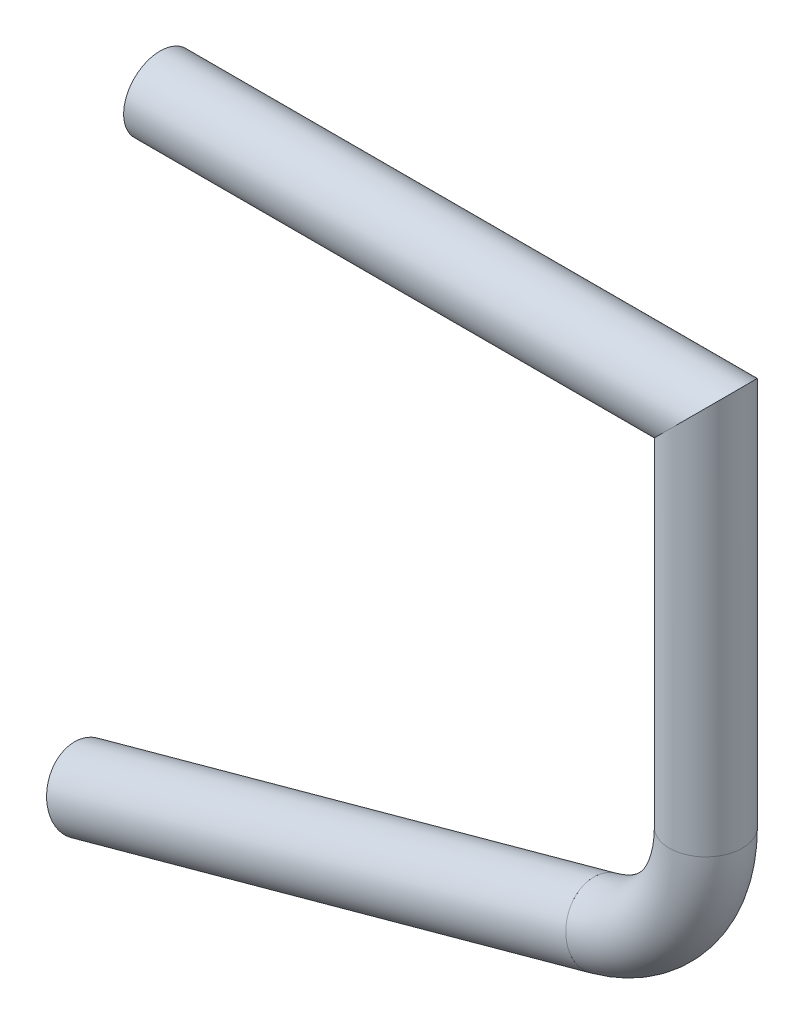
ISO-10303-21;
HEADER;
FILE_DESCRIPTION(('STEP AP214'),'2;1');
FILE_NAME('part.step','',(''),(''),'','','');
FILE_SCHEMA(('AUTOMOTIVE_DESIGN { 1 0 10303 214 1 1 1 1 }'));
ENDSEC;
DATA;
#1=APPLICATION_CONTEXT('core data for automotive mechanical design processes');
#2=APPLICATION_PROTOCOL_DEFINITION('international standard','automotive_design',2000,#1);
#3=PRODUCT_CONTEXT('',#1,'mechanical');
#4=PRODUCT('Part','Part','',(#3));
#5=PRODUCT_RELATED_PRODUCT_CATEGORY('part','',(#4));
#6=PRODUCT_DEFINITION_FORMATION('','',#4);
#7=PRODUCT_DEFINITION_CONTEXT('part definition',#1,'design');
#8=PRODUCT_DEFINITION('design','',#6,#7);
#9=PRODUCT_DEFINITION_SHAPE('','',#8);
#10=(LENGTH_UNIT() NAMED_UNIT(*) SI_UNIT(.MILLI.,.METRE.));
#11=(NAMED_UNIT(*) PLANE_ANGLE_UNIT() SI_UNIT($,.RADIAN.));
#12=(NAMED_UNIT(*) SI_UNIT($,.STERADIAN.) SOLID_ANGLE_UNIT());
#13=UNCERTAINTY_MEASURE_WITH_UNIT(LENGTH_MEASURE(1.E-05),#10,'distance_accuracy_value','');
#14=(GEOMETRIC_REPRESENTATION_CONTEXT(3) GLOBAL_UNCERTAINTY_ASSIGNED_CONTEXT((#13)) GLOBAL_UNIT_ASSIGNED_CONTEXT((#10,
#11,#12)) REPRESENTATION_CONTEXT('',''));
#15=CARTESIAN_POINT('',(0.,0.,0.));
#16=DIRECTION('',(0.,0.,1.));
#17=DIRECTION('',(1.,0.,0.));
#18=AXIS2_PLACEMENT_3D('',#15,#16,#17);
#19=CARTESIAN_POINT('',(-44.1128784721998,-372.16278069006,0.));
#20=DIRECTION('',(0.96435697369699,0.264604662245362,0.));
#21=DIRECTION('',(-0.264604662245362,0.96435697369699,0.));
#22=AXIS2_PLACEMENT_3D('',#19,#20,#21);
#23=CYLINDRICAL_SURFACE('',#22,18.9);
#24=CARTESIAN_POINT('',(-44.1128784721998,-372.16278069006,0.));
#25=DIRECTION('',(-0.964356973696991,-0.264604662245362,0.));
#26=DIRECTION('',(0.,0.,-1.));
#27=AXIS2_PLACEMENT_3D('',#24,#25,#26);
#28=CIRCLE('',#27,18.9);
#29=CARTESIAN_POINT('',(-44.1128784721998,-372.16278069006,-18.9));
#30=VERTEX_POINT('',#29);
#31=EDGE_CURVE('E57',#30,#30,#28,.T.);
#32=ORIENTED_EDGE('',*,*,#31,.T.);
#33=EDGE_LOOP('',(#32));
#34=FACE_BOUND('',#33,.T.);
#35=CARTESIAN_POINT('',(257.983553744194,-289.272184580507,0.));
#36=DIRECTION('',(-0.964356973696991,-0.264604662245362,0.));
#37=DIRECTION('',(0.,0.,-1.));
#38=AXIS2_PLACEMENT_3D('',#35,#36,#37);
#39=CIRCLE('',#38,18.9);
#40=CARTESIAN_POINT('',(257.983553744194,-289.272184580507,-18.9));
#41=VERTEX_POINT('',#40);
#42=EDGE_CURVE('E65',#41,#41,#39,.T.);
#43=ORIENTED_EDGE('',*,*,#42,.F.);
#44=EDGE_LOOP('',(#43));
#45=FACE_BOUND('',#44,.T.);
#46=ADVANCED_FACE('F51',(#34,#45),#23,.F.);
#47=CARTESIAN_POINT('',(-44.1128784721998,-372.16278069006,0.));
#48=DIRECTION('',(0.96435697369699,0.264604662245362,0.));
#49=DIRECTION('',(-0.264604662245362,0.96435697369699,0.));
#50=AXIS2_PLACEMENT_3D('',#47,#48,#49);
#51=CYLINDRICAL_SURFACE('',#50,21.2);
#52=CARTESIAN_POINT('',(-44.1128784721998,-372.16278069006,0.));
#53=DIRECTION('',(-0.964356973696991,-0.264604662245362,0.));
#54=DIRECTION('',(0.,0.,-1.));
#55=AXIS2_PLACEMENT_3D('',#52,#53,#54);
#56=CIRCLE('',#55,21.2);
#57=CARTESIAN_POINT('',(-44.1128784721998,-372.16278069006,-21.2));
#58=VERTEX_POINT('',#57);
#59=EDGE_CURVE('E13',#58,#58,#56,.T.);
#60=ORIENTED_EDGE('',*,*,#59,.F.);
#61=EDGE_LOOP('',(#60));
#62=FACE_BOUND('',#61,.T.);
#63=CARTESIAN_POINT('',(257.983553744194,-289.272184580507,0.));
#64=DIRECTION('',(-0.964356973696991,-0.264604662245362,0.));
#65=DIRECTION('',(0.,0.,-1.));
#66=AXIS2_PLACEMENT_3D('',#63,#64,#65);
#67=CIRCLE('',#66,21.2);
#68=CARTESIAN_POINT('',(257.983553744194,-289.272184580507,-21.2));
#69=VERTEX_POINT('',#68);
#70=EDGE_CURVE('E61',#69,#69,#67,.T.);
#71=ORIENTED_EDGE('',*,*,#70,.T.);
#72=EDGE_LOOP('',(#71));
#73=FACE_BOUND('',#72,.T.);
#74=ADVANCED_FACE('F75',(#62,#73),#51,.T.);
#75=CARTESIAN_POINT('',(-44.1128784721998,-372.16278069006,0.));
#76=DIRECTION('',(-0.964356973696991,-0.264604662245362,0.));
#77=DIRECTION('',(0.,0.,-1.));
#78=AXIS2_PLACEMENT_3D('',#75,#76,#77);
#79=PLANE('',#78);
#80=ORIENTED_EDGE('',*,*,#31,.F.);
#81=EDGE_LOOP('',(#80));
#82=FACE_BOUND('',#81,.T.);
#83=ORIENTED_EDGE('',*,*,#59,.T.);
#84=EDGE_LOOP('',(#83));
#85=FACE_BOUND('',#84,.T.);
#86=ADVANCED_FACE('F79',(#82,#85),#79,.T.);
#87=CARTESIAN_POINT('',(257.983553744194,-289.272184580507,0.));
#88=DIRECTION('',(-0.964356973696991,-0.264604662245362,0.));
#89=DIRECTION('',(0.,0.,-1.));
#90=AXIS2_PLACEMENT_3D('',#87,#88,#89);
#91=PLANE('',#90);
#92=ORIENTED_EDGE('',*,*,#42,.T.);
#93=EDGE_LOOP('',(#92));
#94=FACE_BOUND('',#93,.T.);
#95=ORIENTED_EDGE('',*,*,#70,.F.);
#96=EDGE_LOOP('',(#95));
#97=FACE_BOUND('',#96,.T.);
#98=ADVANCED_FACE('F71',(#94,#97),#91,.F.);
#99=CLOSED_SHELL('',(#46,#74,#86,#98));
#100=MANIFOLD_SOLID_BREP('B2',#99);
#101=CARTESIAN_POINT('',(236.545656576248,-211.141340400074,0.));
#102=DIRECTION('',(0.,0.,1.));
#103=DIRECTION('',(1.,0.,0.));
#104=AXIS2_PLACEMENT_3D('',#101,#102,#103);
#105=TOROIDAL_SURFACE('',#104,81.0185919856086,18.9);
#106=CARTESIAN_POINT('',(257.983553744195,-289.272184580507,0.));
#107=DIRECTION('',(-0.96435697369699,-0.264604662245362,0.));
#108=DIRECTION('',(0.,0.,-1.));
#109=AXIS2_PLACEMENT_3D('',#106,#107,#108);
#110=CIRCLE('',#109,18.9);
#111=CARTESIAN_POINT('',(262.984581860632,-307.49853138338,0.));
#112=VERTEX_POINT('',#111);
#113=EDGE_CURVE('E135',#112,#112,#110,.T.);
#114=CARTESIAN_POINT('',(317.564248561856,-211.141340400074,0.));
#115=DIRECTION('',(0.,-1.,0.));
#116=DIRECTION('',(0.,0.,-1.));
#117=AXIS2_PLACEMENT_3D('',#114,#115,#116);
#118=CIRCLE('',#117,18.9);
#119=CARTESIAN_POINT('',(336.464248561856,-211.141340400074,0.));
#120=VERTEX_POINT('',#119);
#121=EDGE_CURVE('E143',#120,#120,#118,.T.);
#122=CARTESIAN_POINT('',(236.545656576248,-211.141340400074,0.));
#123=DIRECTION('',(0.,0.,1.));
#124=DIRECTION('',(1.,0.,0.));
#125=AXIS2_PLACEMENT_3D('',#122,#123,#124);
#126=CIRCLE('',#125,99.9185919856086);
#127=EDGE_CURVE('',#112,#120,#126,.T.);
#128=ORIENTED_EDGE('',*,*,#113,.T.);
#129=ORIENTED_EDGE('',*,*,#121,.F.);
#130=ORIENTED_EDGE('',*,*,#127,.T.);
#131=ORIENTED_EDGE('',*,*,#127,.F.);
#132=EDGE_LOOP('',(#128,#130,#129,#131));
#133=FACE_BOUND('',#132,.T.);
#134=ADVANCED_FACE('F128',(#133),#105,.F.);
#135=CARTESIAN_POINT('',(236.545656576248,-211.141340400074,0.));
#136=DIRECTION('',(0.,0.,1.));
#137=DIRECTION('',(1.,0.,0.));
#138=AXIS2_PLACEMENT_3D('',#135,#136,#137);
#139=TOROIDAL_SURFACE('',#138,81.0185919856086,21.2);
#140=CARTESIAN_POINT('',(257.983553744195,-289.272184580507,0.));
#141=DIRECTION('',(-0.96435697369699,-0.264604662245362,0.));
#142=DIRECTION('',(0.,0.,-1.));
#143=AXIS2_PLACEMENT_3D('',#140,#141,#142);
#144=CIRCLE('',#143,21.2);
#145=CARTESIAN_POINT('',(263.593172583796,-309.716552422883,0.));
#146=VERTEX_POINT('',#145);
#147=EDGE_CURVE('E50',#146,#146,#144,.T.);
#148=CARTESIAN_POINT('',(317.564248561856,-211.141340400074,0.));
#149=DIRECTION('',(0.,-1.,0.));
#150=DIRECTION('',(0.,0.,-1.));
#151=AXIS2_PLACEMENT_3D('',#148,#149,#150);
#152=CIRCLE('',#151,21.2);
#153=CARTESIAN_POINT('',(338.764248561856,-211.141340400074,0.));
#154=VERTEX_POINT('',#153);
#155=EDGE_CURVE('E139',#154,#154,#152,.T.);
#156=CARTESIAN_POINT('',(236.545656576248,-211.141340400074,0.));
#157=DIRECTION('',(0.,0.,1.));
#158=DIRECTION('',(1.,0.,0.));
#159=AXIS2_PLACEMENT_3D('',#156,#157,#158);
#160=CIRCLE('',#159,102.218591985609);
#161=EDGE_CURVE('',#146,#154,#160,.T.);
#162=ORIENTED_EDGE('',*,*,#147,.F.);
#163=ORIENTED_EDGE('',*,*,#155,.T.);
#164=ORIENTED_EDGE('',*,*,#161,.T.);
#165=ORIENTED_EDGE('',*,*,#161,.F.);
#166=EDGE_LOOP('',(#162,#164,#163,#165));
#167=FACE_BOUND('',#166,.T.);
#168=ADVANCED_FACE('F130',(#167),#139,.T.);
#169=CARTESIAN_POINT('',(257.983553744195,-289.272184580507,0.));
#170=DIRECTION('',(-0.96435697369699,-0.264604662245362,0.));
#171=DIRECTION('',(0.,0.,-1.));
#172=AXIS2_PLACEMENT_3D('',#169,#170,#171);
#173=PLANE('',#172);
#174=ORIENTED_EDGE('',*,*,#113,.F.);
#175=EDGE_LOOP('',(#174));
#176=FACE_BOUND('',#175,.T.);
#177=ORIENTED_EDGE('',*,*,#147,.T.);
#178=EDGE_LOOP('',(#177));
#179=FACE_BOUND('',#178,.T.);
#180=ADVANCED_FACE('F153',(#176,#179),#173,.T.);
#181=CARTESIAN_POINT('',(317.564248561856,-211.141340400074,0.));
#182=DIRECTION('',(0.,-1.,0.));
#183=DIRECTION('',(0.,0.,-1.));
#184=AXIS2_PLACEMENT_3D('',#181,#182,#183);
#185=PLANE('',#184);
#186=ORIENTED_EDGE('',*,*,#121,.T.);
#187=EDGE_LOOP('',(#186));
#188=FACE_BOUND('',#187,.T.);
#189=ORIENTED_EDGE('',*,*,#155,.F.);
#190=EDGE_LOOP('',(#189));
#191=FACE_BOUND('',#190,.T.);
#192=ADVANCED_FACE('F149',(#188,#191),#185,.F.);
#193=CLOSED_SHELL('',(#134,#168,#180,#192));
#194=MANIFOLD_SOLID_BREP('B8',#193);
#195=CARTESIAN_POINT('',(317.564248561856,-211.141340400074,0.));
#196=DIRECTION('',(0.,1.,0.));
#197=DIRECTION('',(0.,0.,1.));
#198=AXIS2_PLACEMENT_3D('',#195,#196,#197);
#199=CYLINDRICAL_SURFACE('',#198,18.9);
#200=CARTESIAN_POINT('',(317.564248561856,0.,0.));
#201=DIRECTION('',(0.707106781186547,-0.707106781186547,0.));
#202=DIRECTION('',(0.707106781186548,0.707106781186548,0.));
#203=AXIS2_PLACEMENT_3D('',#200,#201,#202);
#204=ELLIPSE('',#203,26.7286363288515,18.9);
#205=CARTESIAN_POINT('',(336.464248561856,18.9,0.));
#206=VERTEX_POINT('',#205);
#207=EDGE_CURVE('E210',#206,#206,#204,.T.);
#208=ORIENTED_EDGE('',*,*,#207,.F.);
#209=EDGE_LOOP('',(#208));
#210=FACE_BOUND('',#209,.T.);
#211=CARTESIAN_POINT('',(317.564248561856,-211.141340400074,0.));
#212=DIRECTION('',(0.,-1.,0.));
#213=DIRECTION('',(0.,0.,-1.));
#214=AXIS2_PLACEMENT_3D('',#211,#212,#213);
#215=CIRCLE('',#214,18.9);
#216=CARTESIAN_POINT('',(317.564248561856,-211.141340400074,-18.9));
#217=VERTEX_POINT('',#216);
#218=EDGE_CURVE('E219',#217,#217,#215,.T.);
#219=ORIENTED_EDGE('',*,*,#218,.T.);
#220=EDGE_LOOP('',(#219));
#221=FACE_BOUND('',#220,.T.);
#222=ADVANCED_FACE('F204',(#210,#221),#199,.F.);
#223=CARTESIAN_POINT('',(317.564248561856,-211.141340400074,0.));
#224=DIRECTION('',(0.,-1.,0.));
#225=DIRECTION('',(0.,0.,-1.));
#226=AXIS2_PLACEMENT_3D('',#223,#224,#225);
#227=PLANE('',#226);
#228=ORIENTED_EDGE('',*,*,#218,.F.);
#229=EDGE_LOOP('',(#228));
#230=FACE_BOUND('',#229,.T.);
#231=CARTESIAN_POINT('',(317.564248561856,-211.141340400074,0.));
#232=DIRECTION('',(0.,-1.,0.));
#233=DIRECTION('',(0.,0.,-1.));
#234=AXIS2_PLACEMENT_3D('',#231,#232,#233);
#235=CIRCLE('',#234,21.2);
#236=CARTESIAN_POINT('',(317.564248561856,-211.141340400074,-21.2));
#237=VERTEX_POINT('',#236);
#238=EDGE_CURVE('E214',#237,#237,#235,.T.);
#239=ORIENTED_EDGE('',*,*,#238,.T.);
#240=EDGE_LOOP('',(#239));
#241=FACE_BOUND('',#240,.T.);
#242=ADVANCED_FACE('F225',(#230,#241),#227,.T.);
#243=CARTESIAN_POINT('',(317.564248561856,-211.141340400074,0.));
#244=DIRECTION('',(0.,1.,0.));
#245=DIRECTION('',(0.,0.,1.));
#246=AXIS2_PLACEMENT_3D('',#243,#244,#245);
#247=CYLINDRICAL_SURFACE('',#246,21.2);
#248=CARTESIAN_POINT('',(317.564248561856,0.,0.));
#249=DIRECTION('',(0.707106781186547,-0.707106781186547,0.));
#250=DIRECTION('',(0.707106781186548,0.707106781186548,0.));
#251=AXIS2_PLACEMENT_3D('',#248,#249,#250);
#252=ELLIPSE('',#251,29.9813275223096,21.2);
#253=CARTESIAN_POINT('',(338.764248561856,21.2,0.));
#254=VERTEX_POINT('',#253);
#255=EDGE_CURVE('E127',#254,#254,#252,.T.);
#256=ORIENTED_EDGE('',*,*,#255,.T.);
#257=EDGE_LOOP('',(#256));
#258=FACE_BOUND('',#257,.T.);
#259=ORIENTED_EDGE('',*,*,#238,.F.);
#260=EDGE_LOOP('',(#259));
#261=FACE_BOUND('',#260,.T.);
#262=ADVANCED_FACE('F228',(#258,#261),#247,.T.);
#263=CARTESIAN_POINT('',(317.564248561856,0.,0.));
#264=DIRECTION('',(0.707106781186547,-0.707106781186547,0.));
#265=DIRECTION('',(0.707106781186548,0.707106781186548,0.));
#266=AXIS2_PLACEMENT_3D('',#263,#264,#265);
#267=PLANE('',#266);
#268=ORIENTED_EDGE('',*,*,#207,.T.);
#269=EDGE_LOOP('',(#268));
#270=FACE_BOUND('',#269,.T.);
#271=ORIENTED_EDGE('',*,*,#255,.F.);
#272=EDGE_LOOP('',(#271));
#273=FACE_BOUND('',#272,.T.);
#274=ADVANCED_FACE('F233',(#270,#273),#267,.F.);
#275=CLOSED_SHELL('',(#222,#242,#262,#274));
#276=MANIFOLD_SOLID_BREP('B45',#275);
#277=CARTESIAN_POINT('',(317.564248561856,0.,0.));
#278=DIRECTION('',(-1.,0.,0.));
#279=DIRECTION('',(0.,0.,1.));
#280=AXIS2_PLACEMENT_3D('',#277,#278,#279);
#281=CYLINDRICAL_SURFACE('',#280,18.9);
#282=CARTESIAN_POINT('',(0.,0.,0.));
#283=DIRECTION('',(1.,0.,0.));
#284=DIRECTION('',(0.,0.,-1.));
#285=AXIS2_PLACEMENT_3D('',#282,#283,#284);
#286=CIRCLE('',#285,18.9);
#287=CARTESIAN_POINT('',(0.,0.,-18.9));
#288=VERTEX_POINT('',#287);
#289=EDGE_CURVE('E279',#288,#288,#286,.T.);
#290=ORIENTED_EDGE('',*,*,#289,.F.);
#291=EDGE_LOOP('',(#290));
#292=FACE_BOUND('',#291,.T.);
#293=CARTESIAN_POINT('',(317.564248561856,0.,0.));
#294=DIRECTION('',(0.707106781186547,-0.707106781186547,0.));
#295=DIRECTION('',(-0.707106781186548,-0.707106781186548,0.));
#296=AXIS2_PLACEMENT_3D('',#293,#294,#295);
#297=ELLIPSE('',#296,26.7286363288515,18.9);
#298=CARTESIAN_POINT('',(298.664248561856,-18.9,0.));
#299=VERTEX_POINT('',#298);
#300=EDGE_CURVE('E275',#299,#299,#297,.T.);
#301=ORIENTED_EDGE('',*,*,#300,.T.);
#302=EDGE_LOOP('',(#301));
#303=FACE_BOUND('',#302,.T.);
#304=ADVANCED_FACE('F271',(#292,#303),#281,.F.);
#305=CARTESIAN_POINT('',(317.564248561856,0.,0.));
#306=DIRECTION('',(-1.,0.,0.));
#307=DIRECTION('',(0.,0.,1.));
#308=AXIS2_PLACEMENT_3D('',#305,#306,#307);
#309=CYLINDRICAL_SURFACE('',#308,21.2);
#310=CARTESIAN_POINT('',(0.,0.,0.));
#311=DIRECTION('',(1.,0.,0.));
#312=DIRECTION('',(0.,0.,-1.));
#313=AXIS2_PLACEMENT_3D('',#310,#311,#312);
#314=CIRCLE('',#313,21.2);
#315=CARTESIAN_POINT('',(0.,0.,-21.2));
#316=VERTEX_POINT('',#315);
#317=EDGE_CURVE('E283',#316,#316,#314,.T.);
#318=ORIENTED_EDGE('',*,*,#317,.T.);
#319=EDGE_LOOP('',(#318));
#320=FACE_BOUND('',#319,.T.);
#321=CARTESIAN_POINT('',(317.564248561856,0.,0.));
#322=DIRECTION('',(0.707106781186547,-0.707106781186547,0.));
#323=DIRECTION('',(-0.707106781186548,-0.707106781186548,0.));
#324=AXIS2_PLACEMENT_3D('',#321,#322,#323);
#325=ELLIPSE('',#324,29.9813275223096,21.2);
#326=CARTESIAN_POINT('',(296.364248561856,-21.2,0.));
#327=VERTEX_POINT('',#326);
#328=EDGE_CURVE('E203',#327,#327,#325,.T.);
#329=ORIENTED_EDGE('',*,*,#328,.F.);
#330=EDGE_LOOP('',(#329));
#331=FACE_BOUND('',#330,.T.);
#332=ADVANCED_FACE('F298',(#320,#331),#309,.T.);
#333=CARTESIAN_POINT('',(0.,0.,0.));
#334=DIRECTION('',(1.,0.,0.));
#335=DIRECTION('',(0.,0.,-1.));
#336=AXIS2_PLACEMENT_3D('',#333,#334,#335);
#337=PLANE('',#336);
#338=ORIENTED_EDGE('',*,*,#289,.T.);
#339=EDGE_LOOP('',(#338));
#340=FACE_BOUND('',#339,.T.);
#341=ORIENTED_EDGE('',*,*,#317,.F.);
#342=EDGE_LOOP('',(#341));
#343=FACE_BOUND('',#342,.T.);
#344=ADVANCED_FACE('F294',(#340,#343),#337,.F.);
#345=CARTESIAN_POINT('',(317.564248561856,0.,0.));
#346=DIRECTION('',(0.707106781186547,-0.707106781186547,0.));
#347=DIRECTION('',(0.707106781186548,0.707106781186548,0.));
#348=AXIS2_PLACEMENT_3D('',#345,#346,#347);
#349=PLANE('',#348);
#350=ORIENTED_EDGE('',*,*,#300,.F.);
#351=EDGE_LOOP('',(#350));
#352=FACE_BOUND('',#351,.T.);
#353=ORIENTED_EDGE('',*,*,#328,.T.);
#354=EDGE_LOOP('',(#353));
#355=FACE_BOUND('',#354,.T.);
#356=ADVANCED_FACE('F273',(#352,#355),#349,.T.);
#357=CLOSED_SHELL('',(#304,#332,#344,#356));
#358=MANIFOLD_SOLID_BREP('B122',#357);
#359=ADVANCED_BREP_SHAPE_REPRESENTATION('',(#18,#100,#194,#276,#358),#14);
#360=SHAPE_DEFINITION_REPRESENTATION(#9,#359);
ENDSEC;
END-ISO-10303-21;
